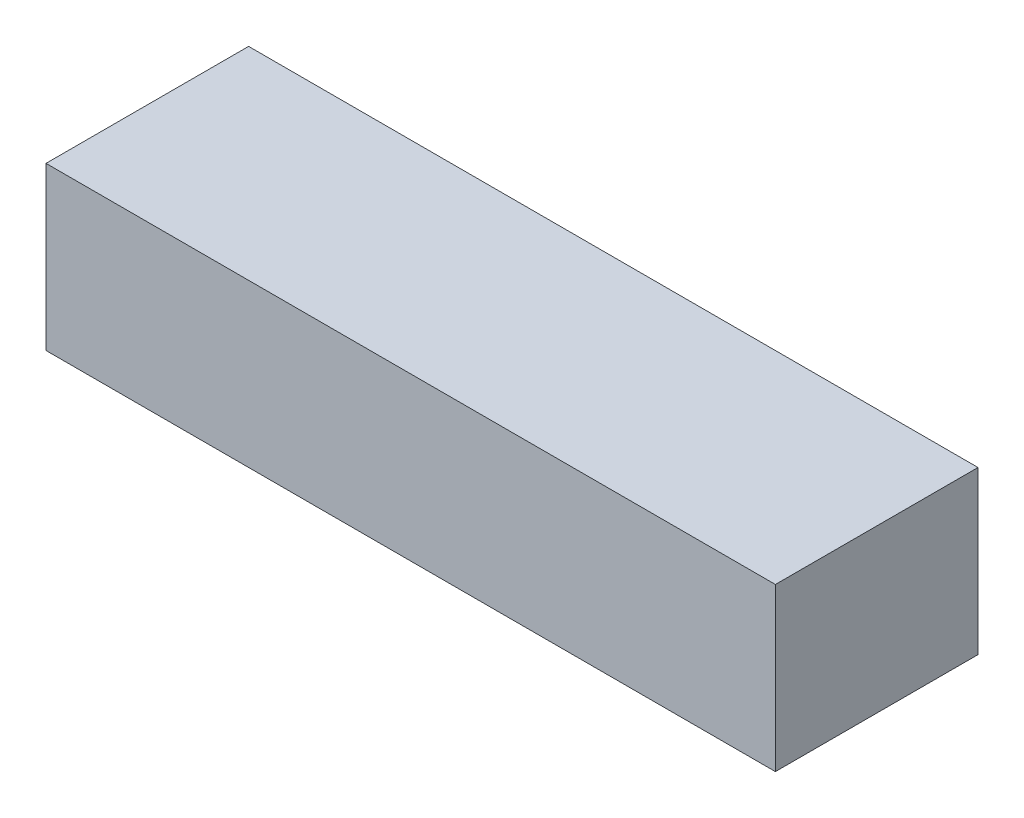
from build123d import *

# Parameters (mm, degrees)
ESQUISSE1_W      = 18
ESQUISSE1_H      = 4
EXTRUSION1_DEPTH = 5


with BuildPart() as part:
    # Esquisse1 → Extrusion1 (new body)
    with BuildSketch(Plane.XY):
        with Locations((9, 2)):
            Rectangle(ESQUISSE1_W, ESQUISSE1_H)
    extrude(amount=EXTRUSION1_DEPTH)


solid = part.part
